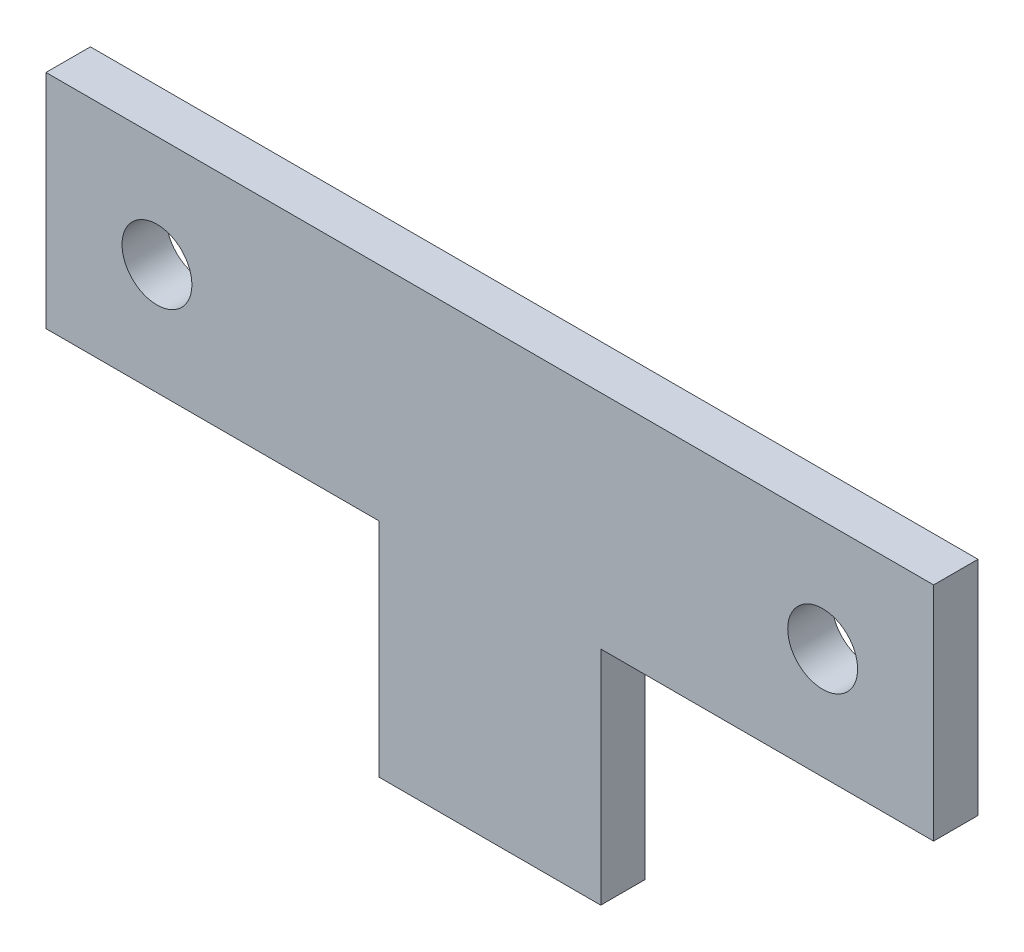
from build123d import *

# Parameters (mm, degrees)
SKETCH1_W           = 101.6
SKETCH1_H           = 25.4
BOSS_EXTRUDE1_DEPTH = 5.08
SKETCH2_R           = 4
CUT_EXTRUDE1_DEPTH  = 53.60928055
SKETCH3_W           = 25.4
SKETCH3_H           = 50.8
BOSS_EXTRUDE2_DEPTH = 5.08


with BuildPart() as part:
    # Sketch1 → Boss-Extrude1 (new body)
    with BuildSketch(Plane.XY):
        Rectangle(SKETCH1_W, SKETCH1_H)
    extrude(amount=BOSS_EXTRUDE1_DEPTH)

    # Sketch2 → Cut-Extrude1 (cut, through all)
    with BuildSketch(Plane.XY.offset(5.08)):
        with Locations((-38.1, 0)):
            Circle(SKETCH2_R)
    cut_extrude1 = extrude(amount=-CUT_EXTRUDE1_DEPTH, mode=Mode.SUBTRACT)

    # Mirror1: Cut-Extrude1 across plane
    add(cut_extrude1.mirror(Plane(origin=(0, 0, 0), x_dir=(0, 0, 1), z_dir=(1, 0, 0))), mode=Mode.SUBTRACT)

    # Sketch3 → Boss-Extrude2 (add)
    with BuildSketch(Plane.XY.offset(5.08)):
        with Locations((0, -12.7)):
            Rectangle(SKETCH3_W, SKETCH3_H)
    extrude(amount=-BOSS_EXTRUDE2_DEPTH)


solid = part.part
